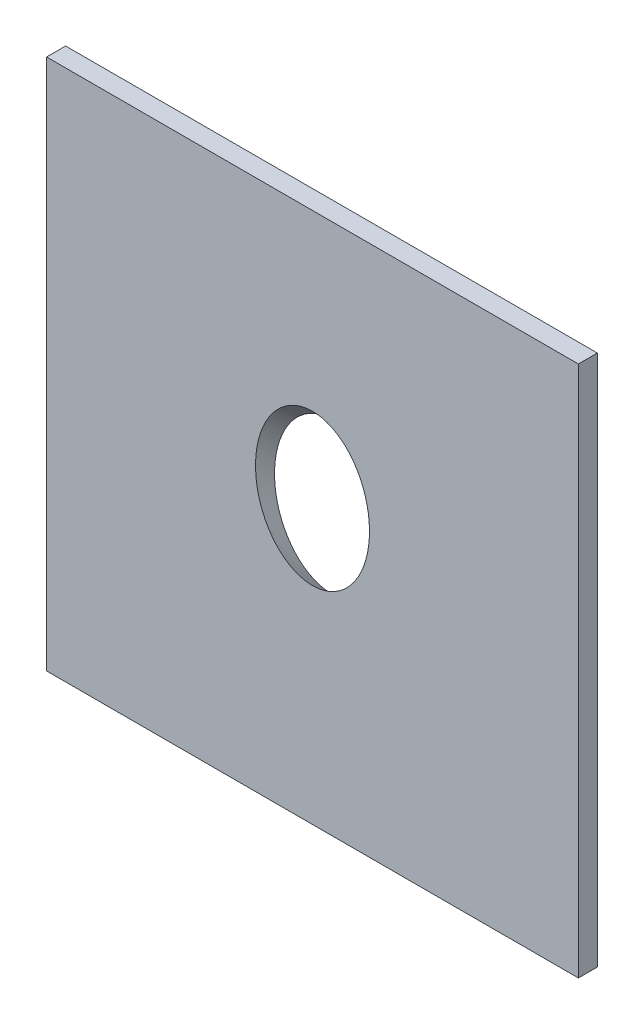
ISO-10303-21;
HEADER;
FILE_DESCRIPTION(('STEP AP214'),'2;1');
FILE_NAME('part.step','',(''),(''),'','','');
FILE_SCHEMA(('AUTOMOTIVE_DESIGN { 1 0 10303 214 1 1 1 1 }'));
ENDSEC;
DATA;
#1=APPLICATION_CONTEXT('core data for automotive mechanical design processes');
#2=APPLICATION_PROTOCOL_DEFINITION('international standard','automotive_design',2000,#1);
#3=PRODUCT_CONTEXT('',#1,'mechanical');
#4=PRODUCT('Part','Part','',(#3));
#5=PRODUCT_RELATED_PRODUCT_CATEGORY('part','',(#4));
#6=PRODUCT_DEFINITION_FORMATION('','',#4);
#7=PRODUCT_DEFINITION_CONTEXT('part definition',#1,'design');
#8=PRODUCT_DEFINITION('design','',#6,#7);
#9=PRODUCT_DEFINITION_SHAPE('','',#8);
#10=(LENGTH_UNIT() NAMED_UNIT(*) SI_UNIT(.MILLI.,.METRE.));
#11=(NAMED_UNIT(*) PLANE_ANGLE_UNIT() SI_UNIT($,.RADIAN.));
#12=(NAMED_UNIT(*) SI_UNIT($,.STERADIAN.) SOLID_ANGLE_UNIT());
#13=UNCERTAINTY_MEASURE_WITH_UNIT(LENGTH_MEASURE(1.E-05),#10,'distance_accuracy_value','');
#14=(GEOMETRIC_REPRESENTATION_CONTEXT(3) GLOBAL_UNCERTAINTY_ASSIGNED_CONTEXT((#13)) GLOBAL_UNIT_ASSIGNED_CONTEXT((#10,
#11,#12)) REPRESENTATION_CONTEXT('',''));
#15=CARTESIAN_POINT('',(0.,0.,0.));
#16=DIRECTION('',(0.,0.,1.));
#17=DIRECTION('',(1.,0.,0.));
#18=AXIS2_PLACEMENT_3D('',#15,#16,#17);
#19=CARTESIAN_POINT('',(-70.0000000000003,70.0000000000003,2.5));
#20=DIRECTION('',(0.,0.,1.));
#21=DIRECTION('',(1.,0.,0.));
#22=AXIS2_PLACEMENT_3D('',#19,#20,#21);
#23=PLANE('',#22);
#24=CARTESIAN_POINT('',(0.,2.17391304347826,2.5));
#25=DIRECTION('',(0.,0.,1.));
#26=DIRECTION('',(0.,-1.,0.));
#27=AXIS2_PLACEMENT_3D('',#24,#25,#26);
#28=ELLIPSE('',#27,19.8779356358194,15.);
#29=CARTESIAN_POINT('',(0.,-17.7040225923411,2.5));
#30=VERTEX_POINT('',#29);
#31=EDGE_CURVE('E13',#30,#30,#28,.F.);
#32=ORIENTED_EDGE('',*,*,#31,.F.);
#33=EDGE_LOOP('',(#32));
#34=FACE_BOUND('',#33,.T.);
#35=DIRECTION('',(0.,-1.,0.));
#36=VECTOR('',#35,1.);
#37=CARTESIAN_POINT('',(69.9999999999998,70.0000000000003,2.5));
#38=LINE('',#37,#36);
#39=CARTESIAN_POINT('',(69.9999999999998,70.0000000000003,2.5));
#40=VERTEX_POINT('',#39);
#41=CARTESIAN_POINT('',(69.9999999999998,-69.9999999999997,2.5));
#42=VERTEX_POINT('',#41);
#43=EDGE_CURVE('E63',#40,#42,#38,.T.);
#44=ORIENTED_EDGE('',*,*,#43,.T.);
#45=DIRECTION('',(-1.,0.,0.));
#46=VECTOR('',#45,1.);
#47=CARTESIAN_POINT('',(-70.0000000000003,-69.9999999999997,2.5));
#48=LINE('',#47,#46);
#49=CARTESIAN_POINT('',(-70.0000000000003,-69.9999999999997,2.5));
#50=VERTEX_POINT('',#49);
#51=EDGE_CURVE('E56',#42,#50,#48,.T.);
#52=ORIENTED_EDGE('',*,*,#51,.T.);
#53=DIRECTION('',(0.,1.,0.));
#54=VECTOR('',#53,1.);
#55=CARTESIAN_POINT('',(-70.0000000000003,70.0000000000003,2.5));
#56=LINE('',#55,#54);
#57=CARTESIAN_POINT('',(-70.0000000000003,70.0000000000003,2.5));
#58=VERTEX_POINT('',#57);
#59=EDGE_CURVE('E73',#50,#58,#56,.T.);
#60=ORIENTED_EDGE('',*,*,#59,.T.);
#61=DIRECTION('',(1.,0.,0.));
#62=VECTOR('',#61,1.);
#63=CARTESIAN_POINT('',(-70.0000000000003,70.0000000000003,2.5));
#64=LINE('',#63,#62);
#65=EDGE_CURVE('E68',#58,#40,#64,.T.);
#66=ORIENTED_EDGE('',*,*,#65,.T.);
#67=EDGE_LOOP('',(#44,#52,#60,#66));
#68=FACE_BOUND('',#67,.T.);
#69=ADVANCED_FACE('F51',(#34,#68),#23,.F.);
#70=OPEN_SHELL('',(#69));
#71=SHELL_BASED_SURFACE_MODEL('B2',(#70));
#72=CARTESIAN_POINT('',(-70.0000000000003,70.0000000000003,5.));
#73=DIRECTION('',(0.,0.,1.));
#74=DIRECTION('',(1.,0.,0.));
#75=AXIS2_PLACEMENT_3D('',#72,#73,#74);
#76=PLANE('',#75);
#77=DIRECTION('',(0.,-1.,0.));
#78=VECTOR('',#77,1.);
#79=CARTESIAN_POINT('',(-70.0000000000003,-69.9999999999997,5.));
#80=LINE('',#79,#78);
#81=CARTESIAN_POINT('',(-70.0000000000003,70.0000000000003,5.));
#82=VERTEX_POINT('',#81);
#83=CARTESIAN_POINT('',(-70.0000000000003,-69.9999999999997,5.));
#84=VERTEX_POINT('',#83);
#85=EDGE_CURVE('E180',#82,#84,#80,.T.);
#86=ORIENTED_EDGE('',*,*,#85,.T.);
#87=DIRECTION('',(1.,0.,0.));
#88=VECTOR('',#87,1.);
#89=CARTESIAN_POINT('',(69.9999999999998,-69.9999999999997,5.));
#90=LINE('',#89,#88);
#91=CARTESIAN_POINT('',(69.9999999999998,-69.9999999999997,5.));
#92=VERTEX_POINT('',#91);
#93=EDGE_CURVE('E175',#84,#92,#90,.T.);
#94=ORIENTED_EDGE('',*,*,#93,.T.);
#95=DIRECTION('',(0.,1.,0.));
#96=VECTOR('',#95,1.);
#97=CARTESIAN_POINT('',(69.9999999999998,-69.9999999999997,5.));
#98=LINE('',#97,#96);
#99=CARTESIAN_POINT('',(69.9999999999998,70.0000000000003,5.));
#100=VERTEX_POINT('',#99);
#101=EDGE_CURVE('E178',#92,#100,#98,.T.);
#102=ORIENTED_EDGE('',*,*,#101,.T.);
#103=DIRECTION('',(-1.,0.,0.));
#104=VECTOR('',#103,1.);
#105=CARTESIAN_POINT('',(69.9999999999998,70.0000000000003,5.));
#106=LINE('',#105,#104);
#107=EDGE_CURVE('E145',#100,#82,#106,.T.);
#108=ORIENTED_EDGE('',*,*,#107,.T.);
#109=EDGE_LOOP('',(#86,#94,#102,#108));
#110=FACE_BOUND('',#109,.T.);
#111=CARTESIAN_POINT('',(0.,4.34782608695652,5.));
#112=DIRECTION('',(0.,0.,1.));
#113=DIRECTION('',(0.,-1.,0.));
#114=AXIS2_PLACEMENT_3D('',#111,#112,#113);
#115=ELLIPSE('',#114,19.8779356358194,15.);
#116=CARTESIAN_POINT('',(0.,-15.5301095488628,5.));
#117=VERTEX_POINT('',#116);
#118=EDGE_CURVE('E195',#117,#117,#115,.T.);
#119=ORIENTED_EDGE('',*,*,#118,.F.);
#120=EDGE_LOOP('',(#119));
#121=FACE_BOUND('',#120,.T.);
#122=ADVANCED_FACE('F128',(#110,#121),#76,.T.);
#123=CARTESIAN_POINT('',(-70.0000000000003,70.0000000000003,0.));
#124=DIRECTION('',(0.,0.,1.));
#125=DIRECTION('',(1.,0.,0.));
#126=AXIS2_PLACEMENT_3D('',#123,#124,#125);
#127=PLANE('',#126);
#128=DIRECTION('',(0.,-1.,0.));
#129=VECTOR('',#128,1.);
#130=CARTESIAN_POINT('',(-70.0000000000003,-69.9999999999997,0.));
#131=LINE('',#130,#129);
#132=CARTESIAN_POINT('',(-70.0000000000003,70.0000000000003,0.));
#133=VERTEX_POINT('',#132);
#134=CARTESIAN_POINT('',(-70.0000000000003,-69.9999999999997,0.));
#135=VERTEX_POINT('',#134);
#136=EDGE_CURVE('E192',#133,#135,#131,.T.);
#137=ORIENTED_EDGE('',*,*,#136,.F.);
#138=DIRECTION('',(-1.,0.,0.));
#139=VECTOR('',#138,1.);
#140=CARTESIAN_POINT('',(69.9999999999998,70.0000000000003,0.));
#141=LINE('',#140,#139);
#142=CARTESIAN_POINT('',(69.9999999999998,70.0000000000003,0.));
#143=VERTEX_POINT('',#142);
#144=EDGE_CURVE('E168',#143,#133,#141,.T.);
#145=ORIENTED_EDGE('',*,*,#144,.F.);
#146=DIRECTION('',(0.,1.,0.));
#147=VECTOR('',#146,1.);
#148=CARTESIAN_POINT('',(69.9999999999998,-69.9999999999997,0.));
#149=LINE('',#148,#147);
#150=CARTESIAN_POINT('',(69.9999999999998,-69.9999999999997,0.));
#151=VERTEX_POINT('',#150);
#152=EDGE_CURVE('E162',#151,#143,#149,.T.);
#153=ORIENTED_EDGE('',*,*,#152,.F.);
#154=DIRECTION('',(1.,0.,0.));
#155=VECTOR('',#154,1.);
#156=CARTESIAN_POINT('',(69.9999999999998,-69.9999999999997,0.));
#157=LINE('',#156,#155);
#158=EDGE_CURVE('E184',#135,#151,#157,.T.);
#159=ORIENTED_EDGE('',*,*,#158,.F.);
#160=EDGE_LOOP('',(#137,#145,#153,#159));
#161=FACE_BOUND('',#160,.T.);
#162=CARTESIAN_POINT('',(0.,0.,0.));
#163=DIRECTION('',(0.,0.,1.));
#164=DIRECTION('',(0.,-1.,0.));
#165=AXIS2_PLACEMENT_3D('',#162,#163,#164);
#166=ELLIPSE('',#165,19.8779356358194,15.);
#167=CARTESIAN_POINT('',(0.,-19.8779356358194,0.));
#168=VERTEX_POINT('',#167);
#169=EDGE_CURVE('E209',#168,#168,#166,.T.);
#170=ORIENTED_EDGE('',*,*,#169,.T.);
#171=EDGE_LOOP('',(#170));
#172=FACE_BOUND('',#171,.T.);
#173=ADVANCED_FACE('F203',(#161,#172),#127,.F.);
#174=CARTESIAN_POINT('',(-70.0000000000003,-69.9999999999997,5.));
#175=DIRECTION('',(1.,0.,0.));
#176=DIRECTION('',(0.,0.,-1.));
#177=AXIS2_PLACEMENT_3D('',#174,#175,#176);
#178=PLANE('',#177);
#179=ORIENTED_EDGE('',*,*,#136,.T.);
#180=DIRECTION('',(0.,0.,-1.));
#181=VECTOR('',#180,1.);
#182=CARTESIAN_POINT('',(-70.0000000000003,-69.9999999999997,5.));
#183=LINE('',#182,#181);
#184=EDGE_CURVE('E49',#84,#135,#183,.T.);
#185=ORIENTED_EDGE('',*,*,#184,.F.);
#186=ORIENTED_EDGE('',*,*,#85,.F.);
#187=DIRECTION('',(0.,0.,-1.));
#188=VECTOR('',#187,1.);
#189=CARTESIAN_POINT('',(-70.0000000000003,70.0000000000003,5.));
#190=LINE('',#189,#188);
#191=EDGE_CURVE('E188',#82,#133,#190,.T.);
#192=ORIENTED_EDGE('',*,*,#191,.T.);
#193=EDGE_LOOP('',(#179,#185,#186,#192));
#194=FACE_BOUND('',#193,.T.);
#195=ADVANCED_FACE('F130',(#194),#178,.F.);
#196=CARTESIAN_POINT('',(69.9999999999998,-69.9999999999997,5.));
#197=DIRECTION('',(0.,1.,0.));
#198=DIRECTION('',(-1.,0.,0.));
#199=AXIS2_PLACEMENT_3D('',#196,#197,#198);
#200=PLANE('',#199);
#201=ORIENTED_EDGE('',*,*,#158,.T.);
#202=DIRECTION('',(0.,0.,-1.));
#203=VECTOR('',#202,1.);
#204=CARTESIAN_POINT('',(69.9999999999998,-69.9999999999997,5.));
#205=LINE('',#204,#203);
#206=EDGE_CURVE('E137',#92,#151,#205,.T.);
#207=ORIENTED_EDGE('',*,*,#206,.F.);
#208=ORIENTED_EDGE('',*,*,#93,.F.);
#209=ORIENTED_EDGE('',*,*,#184,.T.);
#210=EDGE_LOOP('',(#201,#207,#208,#209));
#211=FACE_BOUND('',#210,.T.);
#212=ADVANCED_FACE('F183',(#211),#200,.F.);
#213=CARTESIAN_POINT('',(69.9999999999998,-69.9999999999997,5.));
#214=DIRECTION('',(-1.,0.,0.));
#215=DIRECTION('',(0.,0.,1.));
#216=AXIS2_PLACEMENT_3D('',#213,#214,#215);
#217=PLANE('',#216);
#218=ORIENTED_EDGE('',*,*,#152,.T.);
#219=DIRECTION('',(0.,0.,-1.));
#220=VECTOR('',#219,1.);
#221=CARTESIAN_POINT('',(69.9999999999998,70.0000000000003,5.));
#222=LINE('',#221,#220);
#223=EDGE_CURVE('E185',#100,#143,#222,.T.);
#224=ORIENTED_EDGE('',*,*,#223,.F.);
#225=ORIENTED_EDGE('',*,*,#101,.F.);
#226=ORIENTED_EDGE('',*,*,#206,.T.);
#227=EDGE_LOOP('',(#218,#224,#225,#226));
#228=FACE_BOUND('',#227,.T.);
#229=ADVANCED_FACE('F186',(#228),#217,.F.);
#230=CARTESIAN_POINT('',(69.9999999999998,70.0000000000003,5.));
#231=DIRECTION('',(0.,-1.,0.));
#232=DIRECTION('',(1.,0.,0.));
#233=AXIS2_PLACEMENT_3D('',#230,#231,#232);
#234=PLANE('',#233);
#235=ORIENTED_EDGE('',*,*,#144,.T.);
#236=ORIENTED_EDGE('',*,*,#191,.F.);
#237=ORIENTED_EDGE('',*,*,#107,.F.);
#238=ORIENTED_EDGE('',*,*,#223,.T.);
#239=EDGE_LOOP('',(#235,#236,#237,#238));
#240=FACE_BOUND('',#239,.T.);
#241=ADVANCED_FACE('F200',(#240),#234,.F.);
#242=CARTESIAN_POINT('',(0.,35.6034049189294,40.9439156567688));
#243=DIRECTION('',(0.,-0.656178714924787,-0.754605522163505));
#244=DIRECTION('',(0.,-0.754605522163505,0.656178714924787));
#245=AXIS2_PLACEMENT_3D('',#242,#243,#244);
#246=CYLINDRICAL_SURFACE('',#245,15.);
#247=ORIENTED_EDGE('',*,*,#118,.T.);
#248=EDGE_LOOP('',(#247));
#249=FACE_BOUND('',#248,.T.);
#250=ORIENTED_EDGE('',*,*,#169,.F.);
#251=EDGE_LOOP('',(#250));
#252=FACE_BOUND('',#251,.T.);
#253=ADVANCED_FACE('F213',(#249,#252),#246,.F.);
#254=CLOSED_SHELL('',(#122,#173,#195,#212,#229,#241,#253));
#255=MANIFOLD_SOLID_BREP('B7',#254);
#256=ADVANCED_BREP_SHAPE_REPRESENTATION('',(#18,#255),#14);
#257=MANIFOLD_SURFACE_SHAPE_REPRESENTATION('',(#18,#71),#14);
#258=SHAPE_REPRESENTATION('',(#18),#14);
#259=SHAPE_DEFINITION_REPRESENTATION(#9,#258);
#260=SHAPE_REPRESENTATION_RELATIONSHIP('','',#258,#256);
#261=SHAPE_REPRESENTATION_RELATIONSHIP('','',#258,#257);
ENDSEC;
END-ISO-10303-21;
